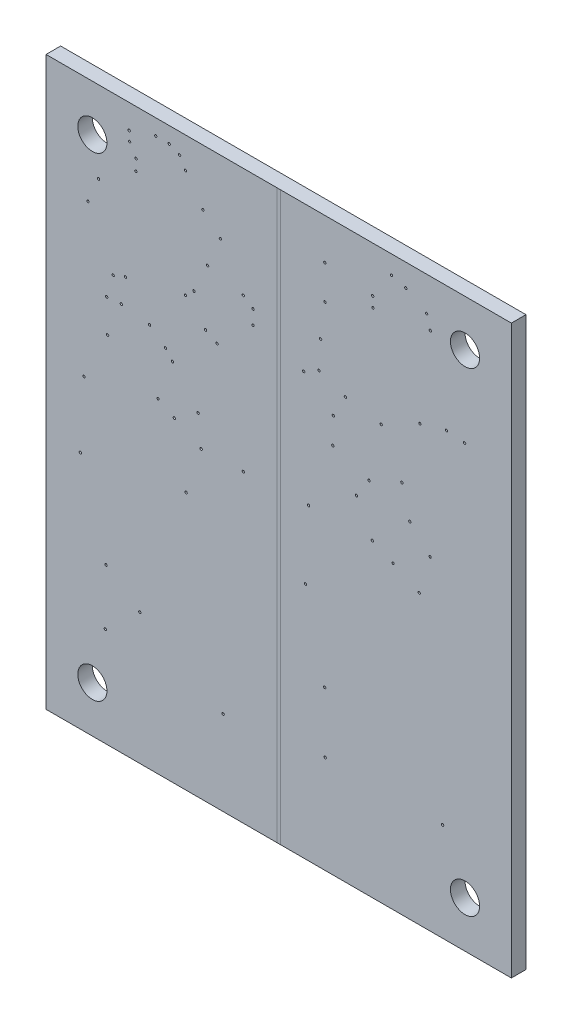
from build123d import *

# Parameters (mm, degrees)
SKETCH1_W           = 51.054
SKETCH1_H           = 62.23
BOARD_OUTLINE_DEPTH = 1.6
SKETCH2_R           = 0.127
NPTH_DEPTH          = 81.508656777
SKETCH3_R           = 1.6
PTH_DEPTH           = 81.508656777


with BuildPart() as part:
    # Sketch1 → Board_Outline (new body)
    with BuildSketch(Plane.XY):
        with Locations((25.527, 31.115)):
            Rectangle(SKETCH1_W, SKETCH1_H)
    extrude(amount=BOARD_OUTLINE_DEPTH)

    # Sketch2 → NPTH (cut, through all)
    with BuildSketch(Plane.XY):
        with Locations((30.607, 54.0004)):
            Circle(SKETCH2_R)
        with Locations((35.8648, 56.0832)):
            Circle(SKETCH2_R)
        with Locations((28.4734, 26.1366)):
            Circle(SKETCH2_R)
        with Locations((30.6324, 10.7442)):
            Circle(SKETCH2_R)
        with Locations((43.5102, 10.7696)):
            Circle(SKETCH2_R)
        with Locations((31.5214, 43.6626)):
            Circle(SKETCH2_R)
        with Locations((35.433, 39.4716)):
            Circle(SKETCH2_R)
        with Locations((36.7792, 45.466)):
            Circle(SKETCH2_R)
        with Locations((42.1386, 35.56)):
            Circle(SKETCH2_R)
        with Locations((4.5974, 50.5714)):
            Circle(SKETCH2_R)
        with Locations((9.8552, 56.0578)):
            Circle(SKETCH2_R)
        with Locations((3.7592, 26.289)):
            Circle(SKETCH2_R)
        with Locations((6.5024, 10.8712)):
            Circle(SKETCH2_R)
        with Locations((6.7564, 38.9382)):
            Circle(SKETCH2_R)
        with Locations((14.0716, 34.7218)):
            Circle(SKETCH2_R)
        with Locations((8.255, 42.6466)):
            Circle(SKETCH2_R)
        with Locations((8.7122, 45.4406)):
            Circle(SKETCH2_R)
        with Locations((19.1262, 54.2798)):
            Circle(SKETCH2_R)
        with Locations((12.2936, 35.6616)):
            Circle(SKETCH2_R)
        with Locations((15.367, 28.2956)):
            Circle(SKETCH2_R)
        with Locations((11.3538, 42.2148)):
            Circle(SKETCH2_R)
        with Locations((19.431, 9.271)):
            Circle(SKETCH2_R)
        with Locations((32.8422, 46.101)):
            Circle(SKETCH2_R)
        with Locations((34.0614, 37.338)):
            Circle(SKETCH2_R)
        with Locations((15.2908, 58.8518)):
            Circle(SKETCH2_R)
        with Locations((18.7706, 44.1452)):
            Circle(SKETCH2_R)
        with Locations((14.6558, 59.9948)):
            Circle(SKETCH2_R)
        with Locations((17.5006, 44.8056)):
            Circle(SKETCH2_R)
        with Locations((13.5128, 60.4774)):
            Circle(SKETCH2_R)
        with Locations((16.2306, 47.8536)):
            Circle(SKETCH2_R)
        with Locations((12.0396, 60.5028)):
            Circle(SKETCH2_R)
        with Locations((15.2908, 46.99)):
            Circle(SKETCH2_R)
        with Locations((22.7076, 49.403)):
            Circle(SKETCH2_R)
        with Locations((22.7076, 47.8536)):
            Circle(SKETCH2_R)
        with Locations((9.1186, 59.563)):
            Circle(SKETCH2_R)
        with Locations((13.8684, 39.9796)):
            Circle(SKETCH2_R)
        with Locations((9.1694, 58.5216)):
            Circle(SKETCH2_R)
        with Locations((13.1064, 40.894)):
            Circle(SKETCH2_R)
        with Locations((17.7292, 51.0286)):
            Circle(SKETCH2_R)
        with Locations((17.018, 33.2486)):
            Circle(SKETCH2_R)
        with Locations((21.6408, 50.165)):
            Circle(SKETCH2_R)
        with Locations((21.6408, 33.401)):
            Circle(SKETCH2_R)
        with Locations((42.164, 57.0738)):
            Circle(SKETCH2_R)
        with Locations((45.9232, 48.26)):
            Circle(SKETCH2_R)
        with Locations((41.7576, 58.4708)):
            Circle(SKETCH2_R)
        with Locations((43.942, 48.4632)):
            Circle(SKETCH2_R)
        with Locations((39.4716, 59.7662)):
            Circle(SKETCH2_R)
        with Locations((41.021, 47.6504)):
            Circle(SKETCH2_R)
        with Locations((37.8968, 60.198)):
            Circle(SKETCH2_R)
        with Locations((39.0398, 41.0718)):
            Circle(SKETCH2_R)
        with Locations((30.1244, 50.2412)):
            Circle(SKETCH2_R)
        with Locations((40.9448, 31.5468)):
            Circle(SKETCH2_R)
        with Locations((28.2702, 46.2534)):
            Circle(SKETCH2_R)
        with Locations((38.0746, 32.9184)):
            Circle(SKETCH2_R)
        with Locations((29.9466, 47.1678)):
            Circle(SKETCH2_R)
        with Locations((35.7886, 33.9344)):
            Circle(SKETCH2_R)
        with Locations((30.5816, 57.7342)):
            Circle(SKETCH2_R)
        with Locations((35.8394, 57.2008)):
            Circle(SKETCH2_R)
        with Locations((28.8036, 33.782)):
            Circle(SKETCH2_R)
        with Locations((30.5816, 17.3736)):
            Circle(SKETCH2_R)
        with Locations((31.4706, 40.7924)):
            Circle(SKETCH2_R)
        with Locations((39.9034, 37.7952)):
            Circle(SKETCH2_R)
        with Locations((9.8806, 57.277)):
            Circle(SKETCH2_R)
        with Locations((5.7658, 53.2892)):
            Circle(SKETCH2_R)
        with Locations((4.1656, 33.7058)):
            Circle(SKETCH2_R)
        with Locations((6.5786, 17.018)):
            Circle(SKETCH2_R)
        with Locations((6.6548, 42.5196)):
            Circle(SKETCH2_R)
        with Locations((16.6878, 36.4998)):
            Circle(SKETCH2_R)
        with Locations((7.366, 44.9326)):
            Circle(SKETCH2_R)
        with Locations((17.2085, 56.0705)):
            Circle(SKETCH2_R)
        with Locations((10.287, 14.3764)):
            Circle(SKETCH2_R)
    extrude(amount=NPTH_DEPTH, mode=Mode.SUBTRACT)

    # Sketch3 → PTH (cut, through all)
    with BuildSketch(Plane.XY):
        with Locations((5.08, 5.08)):
            Circle(SKETCH3_R)
        with Locations((45.97, 5.08)):
            Circle(SKETCH3_R)
        with Locations((45.97, 57.15)):
            Circle(SKETCH3_R)
        with Locations((5.08, 57.15)):
            Circle(SKETCH3_R)
    extrude(amount=PTH_DEPTH, mode=Mode.SUBTRACT)


solid = part.part
